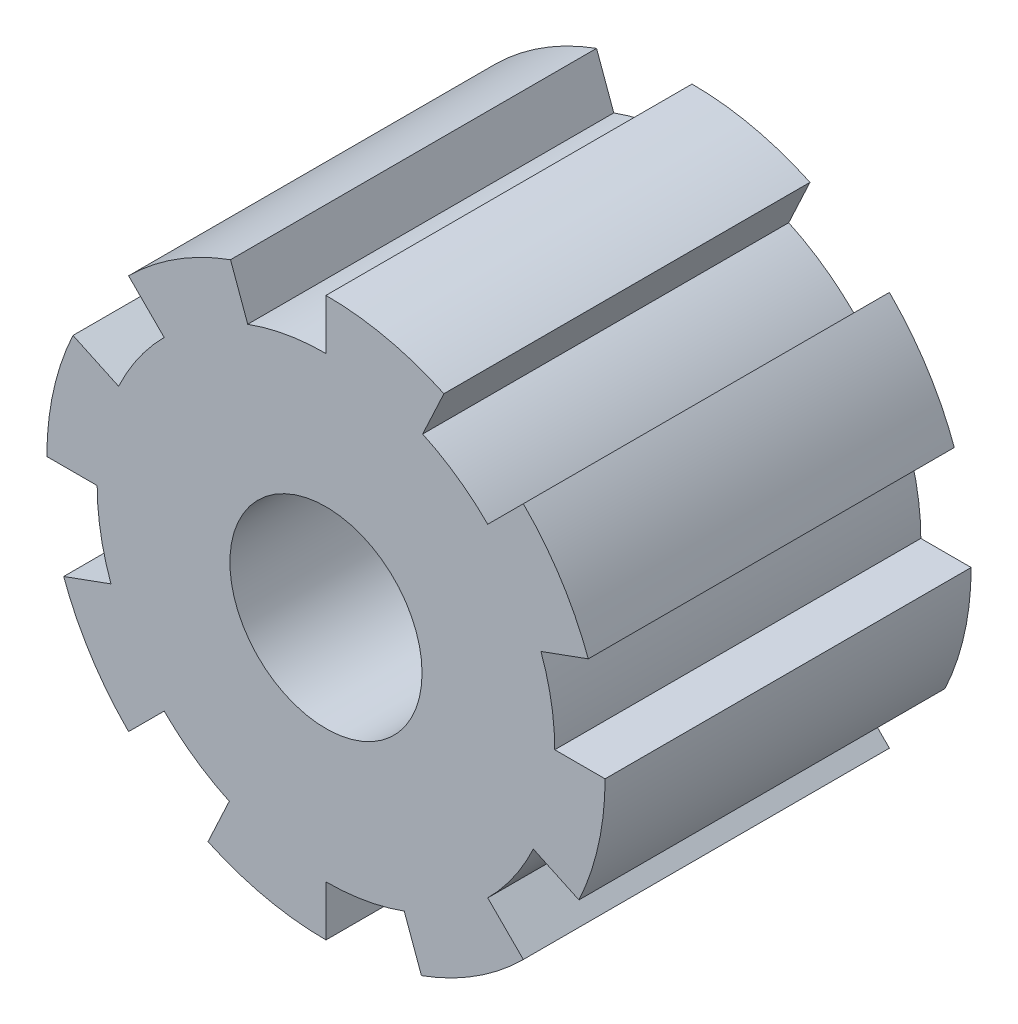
ISO-10303-21;
HEADER;
FILE_DESCRIPTION(('STEP AP214'),'2;1');
FILE_NAME('part.step','',(''),(''),'','','');
FILE_SCHEMA(('AUTOMOTIVE_DESIGN { 1 0 10303 214 1 1 1 1 }'));
ENDSEC;
DATA;
#1=APPLICATION_CONTEXT('core data for automotive mechanical design processes');
#2=APPLICATION_PROTOCOL_DEFINITION('international standard','automotive_design',2000,#1);
#3=PRODUCT_CONTEXT('',#1,'mechanical');
#4=PRODUCT('Part','Part','',(#3));
#5=PRODUCT_RELATED_PRODUCT_CATEGORY('part','',(#4));
#6=PRODUCT_DEFINITION_FORMATION('','',#4);
#7=PRODUCT_DEFINITION_CONTEXT('part definition',#1,'design');
#8=PRODUCT_DEFINITION('design','',#6,#7);
#9=PRODUCT_DEFINITION_SHAPE('','',#8);
#10=(LENGTH_UNIT() NAMED_UNIT(*) SI_UNIT(.MILLI.,.METRE.));
#11=(NAMED_UNIT(*) PLANE_ANGLE_UNIT() SI_UNIT($,.RADIAN.));
#12=(NAMED_UNIT(*) SI_UNIT($,.STERADIAN.) SOLID_ANGLE_UNIT());
#13=UNCERTAINTY_MEASURE_WITH_UNIT(LENGTH_MEASURE(1.E-05),#10,'distance_accuracy_value','');
#14=(GEOMETRIC_REPRESENTATION_CONTEXT(3) GLOBAL_UNCERTAINTY_ASSIGNED_CONTEXT((#13)) GLOBAL_UNIT_ASSIGNED_CONTEXT((#10,
#11,#12)) REPRESENTATION_CONTEXT('',''));
#15=CARTESIAN_POINT('',(0.,0.,0.));
#16=DIRECTION('',(0.,0.,1.));
#17=DIRECTION('',(1.,0.,0.));
#18=AXIS2_PLACEMENT_3D('',#15,#16,#17);
#19=CARTESIAN_POINT('',(0.,0.,8.));
#20=DIRECTION('',(0.,0.,-1.));
#21=DIRECTION('',(-1.,0.,0.));
#22=AXIS2_PLACEMENT_3D('',#19,#20,#21);
#23=CYLINDRICAL_SURFACE('',#22,5.);
#24=CARTESIAN_POINT('',(0.,0.,0.));
#25=DIRECTION('',(0.,0.,1.));
#26=DIRECTION('',(1.,0.,0.));
#27=AXIS2_PLACEMENT_3D('',#24,#25,#26);
#28=CIRCLE('',#27,5.);
#29=CARTESIAN_POINT('',(-5.,0.,0.));
#30=VERTEX_POINT('',#29);
#31=CARTESIAN_POINT('',(-4.69846310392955,-1.71010071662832,0.));
#32=VERTEX_POINT('',#31);
#33=EDGE_CURVE('E47',#30,#32,#28,.T.);
#34=ORIENTED_EDGE('',*,*,#33,.T.);
#35=DIRECTION('',(0.,0.,-1.));
#36=VECTOR('',#35,1.);
#37=CARTESIAN_POINT('',(-4.69846310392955,-1.71010071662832,8.));
#38=LINE('',#37,#36);
#39=CARTESIAN_POINT('',(-4.69846310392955,-1.71010071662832,8.));
#40=VERTEX_POINT('',#39);
#41=EDGE_CURVE('E67',#32,#40,#38,.F.);
#42=ORIENTED_EDGE('',*,*,#41,.T.);
#43=CARTESIAN_POINT('',(0.,0.,8.));
#44=DIRECTION('',(0.,0.,1.));
#45=DIRECTION('',(1.,0.,0.));
#46=AXIS2_PLACEMENT_3D('',#43,#44,#45);
#47=CIRCLE('',#46,5.);
#48=CARTESIAN_POINT('',(-5.,0.,8.));
#49=VERTEX_POINT('',#48);
#50=EDGE_CURVE('E11',#49,#40,#47,.T.);
#51=ORIENTED_EDGE('',*,*,#50,.F.);
#52=DIRECTION('',(0.,0.,-1.));
#53=VECTOR('',#52,1.);
#54=CARTESIAN_POINT('',(-5.,0.,8.));
#55=LINE('',#54,#53);
#56=EDGE_CURVE('E462',#49,#30,#55,.T.);
#57=ORIENTED_EDGE('',*,*,#56,.T.);
#58=EDGE_LOOP('',(#34,#42,#51,#57));
#59=FACE_BOUND('',#58,.T.);
#60=ADVANCED_FACE('F43',(#59),#23,.T.);
#61=CARTESIAN_POINT('',(-3.53553390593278,-3.53553390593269,8.));
#62=VERTEX_POINT('',#61);
#63=CARTESIAN_POINT('',(-2.11309130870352,-4.53153893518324,8.));
#64=VERTEX_POINT('',#63);
#65=EDGE_CURVE('E52',#62,#64,#47,.T.);
#66=ORIENTED_EDGE('',*,*,#65,.F.);
#67=DIRECTION('',(0.,0.,-1.));
#68=VECTOR('',#67,1.);
#69=CARTESIAN_POINT('',(-3.53553390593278,-3.53553390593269,8.));
#70=LINE('',#69,#68);
#71=CARTESIAN_POINT('',(-3.53553390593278,-3.53553390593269,0.));
#72=VERTEX_POINT('',#71);
#73=EDGE_CURVE('E284',#62,#72,#70,.T.);
#74=ORIENTED_EDGE('',*,*,#73,.T.);
#75=CARTESIAN_POINT('',(-2.11309130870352,-4.53153893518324,0.));
#76=VERTEX_POINT('',#75);
#77=EDGE_CURVE('E473',#72,#76,#28,.T.);
#78=ORIENTED_EDGE('',*,*,#77,.T.);
#79=DIRECTION('',(0.,0.,-1.));
#80=VECTOR('',#79,1.);
#81=CARTESIAN_POINT('',(-2.11309130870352,-4.53153893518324,8.));
#82=LINE('',#81,#80);
#83=EDGE_CURVE('E311',#76,#64,#82,.F.);
#84=ORIENTED_EDGE('',*,*,#83,.T.);
#85=EDGE_LOOP('',(#66,#74,#78,#84));
#86=FACE_BOUND('',#85,.T.);
#87=ADVANCED_FACE('F516',(#86),#23,.T.);
#88=CARTESIAN_POINT('',(0.,-5.,8.));
#89=VERTEX_POINT('',#88);
#90=CARTESIAN_POINT('',(1.71010071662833,-4.69846310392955,8.));
#91=VERTEX_POINT('',#90);
#92=EDGE_CURVE('E514',#89,#91,#47,.T.);
#93=ORIENTED_EDGE('',*,*,#92,.F.);
#94=DIRECTION('',(0.,0.,-1.));
#95=VECTOR('',#94,1.);
#96=CARTESIAN_POINT('',(0.,-5.,8.));
#97=LINE('',#96,#95);
#98=CARTESIAN_POINT('',(0.,-5.,0.));
#99=VERTEX_POINT('',#98);
#100=EDGE_CURVE('E291',#89,#99,#97,.T.);
#101=ORIENTED_EDGE('',*,*,#100,.T.);
#102=CARTESIAN_POINT('',(1.71010071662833,-4.69846310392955,0.));
#103=VERTEX_POINT('',#102);
#104=EDGE_CURVE('E475',#99,#103,#28,.T.);
#105=ORIENTED_EDGE('',*,*,#104,.T.);
#106=DIRECTION('',(0.,0.,-1.));
#107=VECTOR('',#106,1.);
#108=CARTESIAN_POINT('',(1.71010071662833,-4.69846310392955,8.));
#109=LINE('',#108,#107);
#110=EDGE_CURVE('E336',#103,#91,#109,.F.);
#111=ORIENTED_EDGE('',*,*,#110,.T.);
#112=EDGE_LOOP('',(#93,#101,#105,#111));
#113=FACE_BOUND('',#112,.T.);
#114=ADVANCED_FACE('F531',(#113),#23,.T.);
#115=CARTESIAN_POINT('',(3.53553390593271,-3.53553390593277,8.));
#116=VERTEX_POINT('',#115);
#117=CARTESIAN_POINT('',(4.53153893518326,-2.11309130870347,8.));
#118=VERTEX_POINT('',#117);
#119=EDGE_CURVE('E513',#116,#118,#47,.T.);
#120=ORIENTED_EDGE('',*,*,#119,.F.);
#121=DIRECTION('',(0.,0.,-1.));
#122=VECTOR('',#121,1.);
#123=CARTESIAN_POINT('',(3.53553390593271,-3.53553390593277,8.));
#124=LINE('',#123,#122);
#125=CARTESIAN_POINT('',(3.53553390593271,-3.53553390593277,0.));
#126=VERTEX_POINT('',#125);
#127=EDGE_CURVE('E333',#116,#126,#124,.T.);
#128=ORIENTED_EDGE('',*,*,#127,.T.);
#129=CARTESIAN_POINT('',(4.53153893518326,-2.11309130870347,0.));
#130=VERTEX_POINT('',#129);
#131=EDGE_CURVE('E477',#126,#130,#28,.T.);
#132=ORIENTED_EDGE('',*,*,#131,.T.);
#133=DIRECTION('',(0.,0.,-1.));
#134=VECTOR('',#133,1.);
#135=CARTESIAN_POINT('',(4.53153893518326,-2.11309130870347,8.));
#136=LINE('',#135,#134);
#137=EDGE_CURVE('E362',#130,#118,#136,.F.);
#138=ORIENTED_EDGE('',*,*,#137,.T.);
#139=EDGE_LOOP('',(#120,#128,#132,#138));
#140=FACE_BOUND('',#139,.T.);
#141=ADVANCED_FACE('F546',(#140),#23,.T.);
#142=CARTESIAN_POINT('',(5.,0.,8.));
#143=VERTEX_POINT('',#142);
#144=CARTESIAN_POINT('',(4.69846310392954,1.71010071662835,8.));
#145=VERTEX_POINT('',#144);
#146=EDGE_CURVE('E512',#143,#145,#47,.T.);
#147=ORIENTED_EDGE('',*,*,#146,.F.);
#148=DIRECTION('',(0.,0.,-1.));
#149=VECTOR('',#148,1.);
#150=CARTESIAN_POINT('',(5.,0.,8.));
#151=LINE('',#150,#149);
#152=CARTESIAN_POINT('',(5.,0.,0.));
#153=VERTEX_POINT('',#152);
#154=EDGE_CURVE('E342',#143,#153,#151,.T.);
#155=ORIENTED_EDGE('',*,*,#154,.T.);
#156=CARTESIAN_POINT('',(4.69846310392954,1.71010071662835,0.));
#157=VERTEX_POINT('',#156);
#158=EDGE_CURVE('E480',#153,#157,#28,.T.);
#159=ORIENTED_EDGE('',*,*,#158,.T.);
#160=DIRECTION('',(0.,0.,-1.));
#161=VECTOR('',#160,1.);
#162=CARTESIAN_POINT('',(4.69846310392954,1.71010071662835,8.));
#163=LINE('',#162,#161);
#164=EDGE_CURVE('E388',#157,#145,#163,.F.);
#165=ORIENTED_EDGE('',*,*,#164,.T.);
#166=EDGE_LOOP('',(#147,#155,#159,#165));
#167=FACE_BOUND('',#166,.T.);
#168=ADVANCED_FACE('F561',(#167),#23,.T.);
#169=CARTESIAN_POINT('',(3.53553390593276,3.53553390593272,8.));
#170=VERTEX_POINT('',#169);
#171=CARTESIAN_POINT('',(2.11309130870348,4.53153893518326,8.));
#172=VERTEX_POINT('',#171);
#173=EDGE_CURVE('E511',#170,#172,#47,.T.);
#174=ORIENTED_EDGE('',*,*,#173,.F.);
#175=DIRECTION('',(0.,0.,-1.));
#176=VECTOR('',#175,1.);
#177=CARTESIAN_POINT('',(3.53553390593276,3.53553390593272,8.));
#178=LINE('',#177,#176);
#179=CARTESIAN_POINT('',(3.53553390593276,3.53553390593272,0.));
#180=VERTEX_POINT('',#179);
#181=EDGE_CURVE('E385',#170,#180,#178,.T.);
#182=ORIENTED_EDGE('',*,*,#181,.T.);
#183=CARTESIAN_POINT('',(2.11309130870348,4.53153893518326,0.));
#184=VERTEX_POINT('',#183);
#185=EDGE_CURVE('E472',#180,#184,#28,.T.);
#186=ORIENTED_EDGE('',*,*,#185,.T.);
#187=DIRECTION('',(0.,0.,-1.));
#188=VECTOR('',#187,1.);
#189=CARTESIAN_POINT('',(2.11309130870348,4.53153893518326,8.));
#190=LINE('',#189,#188);
#191=EDGE_CURVE('E414',#184,#172,#190,.F.);
#192=ORIENTED_EDGE('',*,*,#191,.T.);
#193=EDGE_LOOP('',(#174,#182,#186,#192));
#194=FACE_BOUND('',#193,.T.);
#195=ADVANCED_FACE('F487',(#194),#23,.T.);
#196=CARTESIAN_POINT('',(0.,5.,8.));
#197=VERTEX_POINT('',#196);
#198=CARTESIAN_POINT('',(-1.71010071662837,4.69846310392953,8.));
#199=VERTEX_POINT('',#198);
#200=EDGE_CURVE('E474',#197,#199,#47,.T.);
#201=ORIENTED_EDGE('',*,*,#200,.F.);
#202=DIRECTION('',(0.,0.,-1.));
#203=VECTOR('',#202,1.);
#204=CARTESIAN_POINT('',(0.,5.,8.));
#205=LINE('',#204,#203);
#206=CARTESIAN_POINT('',(0.,5.,0.));
#207=VERTEX_POINT('',#206);
#208=EDGE_CURVE('E394',#197,#207,#205,.T.);
#209=ORIENTED_EDGE('',*,*,#208,.T.);
#210=CARTESIAN_POINT('',(-1.71010071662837,4.69846310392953,0.));
#211=VERTEX_POINT('',#210);
#212=EDGE_CURVE('E471',#207,#211,#28,.T.);
#213=ORIENTED_EDGE('',*,*,#212,.T.);
#214=DIRECTION('',(0.,0.,-1.));
#215=VECTOR('',#214,1.);
#216=CARTESIAN_POINT('',(-1.71010071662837,4.69846310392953,8.));
#217=LINE('',#216,#215);
#218=EDGE_CURVE('E440',#211,#199,#217,.F.);
#219=ORIENTED_EDGE('',*,*,#218,.T.);
#220=EDGE_LOOP('',(#201,#209,#213,#219));
#221=FACE_BOUND('',#220,.T.);
#222=ADVANCED_FACE('F508',(#221),#23,.T.);
#223=CARTESIAN_POINT('',(-3.53553390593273,3.53553390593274,8.));
#224=VERTEX_POINT('',#223);
#225=CARTESIAN_POINT('',(-4.53153893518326,2.11309130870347,8.));
#226=VERTEX_POINT('',#225);
#227=EDGE_CURVE('E53',#224,#226,#47,.T.);
#228=ORIENTED_EDGE('',*,*,#227,.F.);
#229=DIRECTION('',(0.,0.,-1.));
#230=VECTOR('',#229,1.);
#231=CARTESIAN_POINT('',(-3.53553390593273,3.53553390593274,8.));
#232=LINE('',#231,#230);
#233=CARTESIAN_POINT('',(-3.53553390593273,3.53553390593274,0.));
#234=VERTEX_POINT('',#233);
#235=EDGE_CURVE('E437',#224,#234,#232,.T.);
#236=ORIENTED_EDGE('',*,*,#235,.T.);
#237=CARTESIAN_POINT('',(-4.53153893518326,2.11309130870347,0.));
#238=VERTEX_POINT('',#237);
#239=EDGE_CURVE('E467',#234,#238,#28,.T.);
#240=ORIENTED_EDGE('',*,*,#239,.T.);
#241=DIRECTION('',(0.,0.,-1.));
#242=VECTOR('',#241,1.);
#243=CARTESIAN_POINT('',(-4.53153893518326,2.11309130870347,8.));
#244=LINE('',#243,#242);
#245=EDGE_CURVE('E465',#238,#226,#244,.F.);
#246=ORIENTED_EDGE('',*,*,#245,.T.);
#247=EDGE_LOOP('',(#228,#236,#240,#246));
#248=FACE_BOUND('',#247,.T.);
#249=ADVANCED_FACE('F45',(#248),#23,.T.);
#250=CARTESIAN_POINT('',(0.,0.,8.));
#251=DIRECTION('',(0.,0.,1.));
#252=DIRECTION('',(1.,0.,0.));
#253=AXIS2_PLACEMENT_3D('',#250,#251,#252);
#254=PLANE('',#253);
#255=CARTESIAN_POINT('',(0.,0.,8.));
#256=DIRECTION('',(0.,0.,1.));
#257=DIRECTION('',(1.,0.,0.));
#258=AXIS2_PLACEMENT_3D('',#255,#256,#257);
#259=CIRCLE('',#258,2.1);
#260=CARTESIAN_POINT('',(2.1,0.,8.));
#261=VERTEX_POINT('',#260);
#262=EDGE_CURVE('E635',#261,#261,#259,.T.);
#263=ORIENTED_EDGE('',*,*,#262,.F.);
#264=EDGE_LOOP('',(#263));
#265=FACE_BOUND('',#264,.T.);
#266=ORIENTED_EDGE('',*,*,#50,.T.);
#267=DIRECTION('',(-0.93969262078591,-0.342020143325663,0.));
#268=VECTOR('',#267,1.);
#269=CARTESIAN_POINT('',(-5.73212498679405,-2.08632287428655,8.));
#270=LINE('',#269,#268);
#271=CARTESIAN_POINT('',(-5.73212498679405,-2.08632287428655,8.));
#272=VERTEX_POINT('',#271);
#273=EDGE_CURVE('E253',#40,#272,#270,.T.);
#274=ORIENTED_EDGE('',*,*,#273,.T.);
#275=CARTESIAN_POINT('',(0.,0.,8.));
#276=DIRECTION('',(0.,0.,1.));
#277=DIRECTION('',(0.707106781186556,0.707106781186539,0.));
#278=AXIS2_PLACEMENT_3D('',#275,#276,#277);
#279=CIRCLE('',#278,6.1);
#280=CARTESIAN_POINT('',(-4.31335136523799,-4.31335136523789,8.));
#281=VERTEX_POINT('',#280);
#282=EDGE_CURVE('E258',#272,#281,#279,.T.);
#283=ORIENTED_EDGE('',*,*,#282,.T.);
#284=DIRECTION('',(0.707106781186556,0.707106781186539,0.));
#285=VECTOR('',#284,1.);
#286=CARTESIAN_POINT('',(0.,0.,8.));
#287=LINE('',#286,#285);
#288=EDGE_CURVE('E276',#281,#62,#287,.T.);
#289=ORIENTED_EDGE('',*,*,#288,.T.);
#290=ORIENTED_EDGE('',*,*,#65,.T.);
#291=DIRECTION('',(-0.422618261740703,-0.906307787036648,0.));
#292=VECTOR('',#291,1.);
#293=CARTESIAN_POINT('',(-2.57797139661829,-5.52847750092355,8.));
#294=LINE('',#293,#292);
#295=CARTESIAN_POINT('',(-2.57797139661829,-5.52847750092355,8.));
#296=VERTEX_POINT('',#295);
#297=EDGE_CURVE('E297',#64,#296,#294,.T.);
#298=ORIENTED_EDGE('',*,*,#297,.T.);
#299=CARTESIAN_POINT('',(0.,0.,8.));
#300=DIRECTION('',(0.,0.,1.));
#301=DIRECTION('',(0.,1.,0.));
#302=AXIS2_PLACEMENT_3D('',#299,#300,#301);
#303=CIRCLE('',#302,6.1);
#304=CARTESIAN_POINT('',(0.,-6.1,8.));
#305=VERTEX_POINT('',#304);
#306=EDGE_CURVE('E302',#296,#305,#303,.T.);
#307=ORIENTED_EDGE('',*,*,#306,.T.);
#308=DIRECTION('',(0.,1.,0.));
#309=VECTOR('',#308,1.);
#310=CARTESIAN_POINT('',(0.,0.,8.));
#311=LINE('',#310,#309);
#312=EDGE_CURVE('E298',#305,#89,#311,.T.);
#313=ORIENTED_EDGE('',*,*,#312,.T.);
#314=ORIENTED_EDGE('',*,*,#92,.T.);
#315=DIRECTION('',(0.342020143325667,-0.939692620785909,0.));
#316=VECTOR('',#315,1.);
#317=CARTESIAN_POINT('',(2.08632287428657,-5.73212498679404,8.));
#318=LINE('',#317,#316);
#319=CARTESIAN_POINT('',(2.08632287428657,-5.73212498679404,8.));
#320=VERTEX_POINT('',#319);
#321=EDGE_CURVE('E321',#91,#320,#318,.T.);
#322=ORIENTED_EDGE('',*,*,#321,.T.);
#323=CARTESIAN_POINT('',(0.,0.,8.));
#324=DIRECTION('',(0.,0.,1.));
#325=DIRECTION('',(-0.707106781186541,0.707106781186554,0.));
#326=AXIS2_PLACEMENT_3D('',#323,#324,#325);
#327=CIRCLE('',#326,6.1);
#328=CARTESIAN_POINT('',(4.3133513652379,-4.31335136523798,8.));
#329=VERTEX_POINT('',#328);
#330=EDGE_CURVE('E323',#320,#329,#327,.T.);
#331=ORIENTED_EDGE('',*,*,#330,.T.);
#332=DIRECTION('',(-0.707106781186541,0.707106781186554,0.));
#333=VECTOR('',#332,1.);
#334=CARTESIAN_POINT('',(0.,0.,8.));
#335=LINE('',#334,#333);
#336=EDGE_CURVE('E320',#329,#116,#335,.T.);
#337=ORIENTED_EDGE('',*,*,#336,.T.);
#338=ORIENTED_EDGE('',*,*,#119,.T.);
#339=DIRECTION('',(0.906307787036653,-0.422618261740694,0.));
#340=VECTOR('',#339,1.);
#341=CARTESIAN_POINT('',(5.52847750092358,-2.57797139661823,8.));
#342=LINE('',#341,#340);
#343=CARTESIAN_POINT('',(5.52847750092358,-2.57797139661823,8.));
#344=VERTEX_POINT('',#343);
#345=EDGE_CURVE('E348',#118,#344,#342,.T.);
#346=ORIENTED_EDGE('',*,*,#345,.T.);
#347=CARTESIAN_POINT('',(0.,0.,8.));
#348=DIRECTION('',(0.,0.,1.));
#349=DIRECTION('',(-1.,0.,0.));
#350=AXIS2_PLACEMENT_3D('',#347,#348,#349);
#351=CIRCLE('',#350,6.1);
#352=CARTESIAN_POINT('',(6.1,0.,8.));
#353=VERTEX_POINT('',#352);
#354=EDGE_CURVE('E353',#344,#353,#351,.T.);
#355=ORIENTED_EDGE('',*,*,#354,.T.);
#356=DIRECTION('',(-1.,0.,0.));
#357=VECTOR('',#356,1.);
#358=CARTESIAN_POINT('',(0.,0.,8.));
#359=LINE('',#358,#357);
#360=EDGE_CURVE('E349',#353,#143,#359,.T.);
#361=ORIENTED_EDGE('',*,*,#360,.T.);
#362=ORIENTED_EDGE('',*,*,#146,.T.);
#363=DIRECTION('',(0.939692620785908,0.34202014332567,0.));
#364=VECTOR('',#363,1.);
#365=CARTESIAN_POINT('',(5.73212498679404,2.08632287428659,8.));
#366=LINE('',#365,#364);
#367=CARTESIAN_POINT('',(5.73212498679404,2.08632287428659,8.));
#368=VERTEX_POINT('',#367);
#369=EDGE_CURVE('E373',#145,#368,#366,.T.);
#370=ORIENTED_EDGE('',*,*,#369,.T.);
#371=CARTESIAN_POINT('',(0.,0.,8.));
#372=DIRECTION('',(0.,0.,1.));
#373=DIRECTION('',(-0.707106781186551,-0.707106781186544,0.));
#374=AXIS2_PLACEMENT_3D('',#371,#372,#373);
#375=CIRCLE('',#374,6.1);
#376=CARTESIAN_POINT('',(4.31335136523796,4.31335136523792,8.));
#377=VERTEX_POINT('',#376);
#378=EDGE_CURVE('E375',#368,#377,#375,.T.);
#379=ORIENTED_EDGE('',*,*,#378,.T.);
#380=DIRECTION('',(-0.707106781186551,-0.707106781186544,0.));
#381=VECTOR('',#380,1.);
#382=CARTESIAN_POINT('',(0.,0.,8.));
#383=LINE('',#382,#381);
#384=EDGE_CURVE('E372',#377,#170,#383,.T.);
#385=ORIENTED_EDGE('',*,*,#384,.T.);
#386=ORIENTED_EDGE('',*,*,#173,.T.);
#387=DIRECTION('',(0.422618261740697,0.906307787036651,0.));
#388=VECTOR('',#387,1.);
#389=CARTESIAN_POINT('',(2.57797139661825,5.52847750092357,8.));
#390=LINE('',#389,#388);
#391=CARTESIAN_POINT('',(2.57797139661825,5.52847750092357,8.));
#392=VERTEX_POINT('',#391);
#393=EDGE_CURVE('E400',#172,#392,#390,.T.);
#394=ORIENTED_EDGE('',*,*,#393,.T.);
#395=CARTESIAN_POINT('',(0.,0.,8.));
#396=DIRECTION('',(0.,0.,1.));
#397=DIRECTION('',(0.,-1.,0.));
#398=AXIS2_PLACEMENT_3D('',#395,#396,#397);
#399=CIRCLE('',#398,6.1);
#400=CARTESIAN_POINT('',(0.,6.1,8.));
#401=VERTEX_POINT('',#400);
#402=EDGE_CURVE('E405',#392,#401,#399,.T.);
#403=ORIENTED_EDGE('',*,*,#402,.T.);
#404=DIRECTION('',(0.,-1.,0.));
#405=VECTOR('',#404,1.);
#406=CARTESIAN_POINT('',(0.,0.,8.));
#407=LINE('',#406,#405);
#408=EDGE_CURVE('E401',#401,#197,#407,.T.);
#409=ORIENTED_EDGE('',*,*,#408,.T.);
#410=ORIENTED_EDGE('',*,*,#200,.T.);
#411=DIRECTION('',(-0.342020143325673,0.939692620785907,0.));
#412=VECTOR('',#411,1.);
#413=CARTESIAN_POINT('',(-2.08632287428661,5.73212498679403,8.));
#414=LINE('',#413,#412);
#415=CARTESIAN_POINT('',(-2.08632287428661,5.73212498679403,8.));
#416=VERTEX_POINT('',#415);
#417=EDGE_CURVE('E417',#199,#416,#414,.T.);
#418=ORIENTED_EDGE('',*,*,#417,.T.);
#419=CARTESIAN_POINT('',(0.,0.,8.));
#420=DIRECTION('',(0.,0.,1.));
#421=DIRECTION('',(0.707106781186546,-0.707106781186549,0.));
#422=AXIS2_PLACEMENT_3D('',#419,#420,#421);
#423=CIRCLE('',#422,6.1);
#424=CARTESIAN_POINT('',(-4.31335136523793,4.31335136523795,8.));
#425=VERTEX_POINT('',#424);
#426=EDGE_CURVE('E426',#416,#425,#423,.T.);
#427=ORIENTED_EDGE('',*,*,#426,.T.);
#428=DIRECTION('',(0.707106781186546,-0.707106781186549,0.));
#429=VECTOR('',#428,1.);
#430=CARTESIAN_POINT('',(0.,0.,8.));
#431=LINE('',#430,#429);
#432=EDGE_CURVE('E429',#425,#224,#431,.T.);
#433=ORIENTED_EDGE('',*,*,#432,.T.);
#434=ORIENTED_EDGE('',*,*,#227,.T.);
#435=DIRECTION('',(-0.906307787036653,0.422618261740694,0.));
#436=VECTOR('',#435,1.);
#437=CARTESIAN_POINT('',(-5.52847750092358,2.57797139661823,8.));
#438=LINE('',#437,#436);
#439=CARTESIAN_POINT('',(-5.52847750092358,2.57797139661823,8.));
#440=VERTEX_POINT('',#439);
#441=EDGE_CURVE('E443',#226,#440,#438,.T.);
#442=ORIENTED_EDGE('',*,*,#441,.T.);
#443=CARTESIAN_POINT('',(0.,0.,8.));
#444=DIRECTION('',(0.,0.,1.));
#445=DIRECTION('',(1.,0.,0.));
#446=AXIS2_PLACEMENT_3D('',#443,#444,#445);
#447=CIRCLE('',#446,6.1);
#448=CARTESIAN_POINT('',(-6.1,0.,8.));
#449=VERTEX_POINT('',#448);
#450=EDGE_CURVE('E452',#440,#449,#447,.T.);
#451=ORIENTED_EDGE('',*,*,#450,.T.);
#452=DIRECTION('',(1.,0.,0.));
#453=VECTOR('',#452,1.);
#454=CARTESIAN_POINT('',(0.,0.,8.));
#455=LINE('',#454,#453);
#456=EDGE_CURVE('E455',#449,#49,#455,.T.);
#457=ORIENTED_EDGE('',*,*,#456,.T.);
#458=EDGE_LOOP('',(#266,#274,#283,#289,#290,#298,#307,#313,#314,#322,#331,#337,#338,#346,#355,
#361,#362,#370,#379,#385,#386,#394,#403,#409,#410,#418,#427,#433,#434,#442,#451,#457));
#459=FACE_BOUND('',#458,.T.);
#460=ADVANCED_FACE('F255',(#265,#459),#254,.T.);
#461=CARTESIAN_POINT('',(0.,0.,0.));
#462=DIRECTION('',(0.,0.,1.));
#463=DIRECTION('',(1.,0.,0.));
#464=AXIS2_PLACEMENT_3D('',#461,#462,#463);
#465=PLANE('',#464);
#466=CARTESIAN_POINT('',(0.,0.,0.));
#467=DIRECTION('',(0.,0.,1.));
#468=DIRECTION('',(1.,0.,0.));
#469=AXIS2_PLACEMENT_3D('',#466,#467,#468);
#470=CIRCLE('',#469,2.1);
#471=CARTESIAN_POINT('',(2.1,0.,0.));
#472=VERTEX_POINT('',#471);
#473=EDGE_CURVE('E272',#472,#472,#470,.T.);
#474=ORIENTED_EDGE('',*,*,#473,.T.);
#475=EDGE_LOOP('',(#474));
#476=FACE_BOUND('',#475,.T.);
#477=ORIENTED_EDGE('',*,*,#77,.F.);
#478=DIRECTION('',(-0.707106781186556,-0.707106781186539,0.));
#479=VECTOR('',#478,1.);
#480=CARTESIAN_POINT('',(0.,0.,0.));
#481=LINE('',#480,#479);
#482=CARTESIAN_POINT('',(-4.31335136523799,-4.31335136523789,0.));
#483=VERTEX_POINT('',#482);
#484=EDGE_CURVE('E285',#72,#483,#481,.T.);
#485=ORIENTED_EDGE('',*,*,#484,.T.);
#486=CARTESIAN_POINT('',(0.,0.,0.));
#487=DIRECTION('',(0.,0.,1.));
#488=DIRECTION('',(1.,0.,0.));
#489=AXIS2_PLACEMENT_3D('',#486,#487,#488);
#490=CIRCLE('',#489,6.1);
#491=CARTESIAN_POINT('',(-5.73212498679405,-2.08632287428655,0.));
#492=VERTEX_POINT('',#491);
#493=EDGE_CURVE('E282',#483,#492,#490,.F.);
#494=ORIENTED_EDGE('',*,*,#493,.T.);
#495=DIRECTION('',(0.93969262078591,0.342020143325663,0.));
#496=VECTOR('',#495,1.);
#497=CARTESIAN_POINT('',(-5.73212498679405,-2.08632287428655,0.));
#498=LINE('',#497,#496);
#499=EDGE_CURVE('E269',#492,#32,#498,.T.);
#500=ORIENTED_EDGE('',*,*,#499,.T.);
#501=ORIENTED_EDGE('',*,*,#33,.F.);
#502=DIRECTION('',(-1.,0.,0.));
#503=VECTOR('',#502,1.);
#504=CARTESIAN_POINT('',(0.,0.,0.));
#505=LINE('',#504,#503);
#506=CARTESIAN_POINT('',(-6.1,0.,0.));
#507=VERTEX_POINT('',#506);
#508=EDGE_CURVE('E444',#30,#507,#505,.T.);
#509=ORIENTED_EDGE('',*,*,#508,.T.);
#510=CARTESIAN_POINT('',(0.,0.,0.));
#511=DIRECTION('',(0.,0.,1.));
#512=DIRECTION('',(1.,0.,0.));
#513=AXIS2_PLACEMENT_3D('',#510,#511,#512);
#514=CIRCLE('',#513,6.1);
#515=CARTESIAN_POINT('',(-5.52847750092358,2.57797139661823,0.));
#516=VERTEX_POINT('',#515);
#517=EDGE_CURVE('E450',#507,#516,#514,.F.);
#518=ORIENTED_EDGE('',*,*,#517,.T.);
#519=DIRECTION('',(0.906307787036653,-0.422618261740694,0.));
#520=VECTOR('',#519,1.);
#521=CARTESIAN_POINT('',(-5.52847750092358,2.57797139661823,0.));
#522=LINE('',#521,#520);
#523=EDGE_CURVE('E446',#516,#238,#522,.T.);
#524=ORIENTED_EDGE('',*,*,#523,.T.);
#525=ORIENTED_EDGE('',*,*,#239,.F.);
#526=DIRECTION('',(-0.707106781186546,0.707106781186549,0.));
#527=VECTOR('',#526,1.);
#528=CARTESIAN_POINT('',(0.,0.,0.));
#529=LINE('',#528,#527);
#530=CARTESIAN_POINT('',(-4.31335136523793,4.31335136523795,0.));
#531=VERTEX_POINT('',#530);
#532=EDGE_CURVE('E418',#234,#531,#529,.T.);
#533=ORIENTED_EDGE('',*,*,#532,.T.);
#534=CARTESIAN_POINT('',(0.,0.,0.));
#535=DIRECTION('',(0.,0.,1.));
#536=DIRECTION('',(1.,0.,0.));
#537=AXIS2_PLACEMENT_3D('',#534,#535,#536);
#538=CIRCLE('',#537,6.1);
#539=CARTESIAN_POINT('',(-2.08632287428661,5.73212498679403,0.));
#540=VERTEX_POINT('',#539);
#541=EDGE_CURVE('E424',#531,#540,#538,.F.);
#542=ORIENTED_EDGE('',*,*,#541,.T.);
#543=DIRECTION('',(0.342020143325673,-0.939692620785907,0.));
#544=VECTOR('',#543,1.);
#545=CARTESIAN_POINT('',(-2.08632287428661,5.73212498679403,0.));
#546=LINE('',#545,#544);
#547=EDGE_CURVE('E420',#540,#211,#546,.T.);
#548=ORIENTED_EDGE('',*,*,#547,.T.);
#549=ORIENTED_EDGE('',*,*,#212,.F.);
#550=DIRECTION('',(0.,1.,0.));
#551=VECTOR('',#550,1.);
#552=CARTESIAN_POINT('',(0.,0.,0.));
#553=LINE('',#552,#551);
#554=CARTESIAN_POINT('',(0.,6.1,0.));
#555=VERTEX_POINT('',#554);
#556=EDGE_CURVE('E395',#207,#555,#553,.T.);
#557=ORIENTED_EDGE('',*,*,#556,.T.);
#558=CARTESIAN_POINT('',(0.,0.,0.));
#559=DIRECTION('',(0.,0.,1.));
#560=DIRECTION('',(1.,0.,0.));
#561=AXIS2_PLACEMENT_3D('',#558,#559,#560);
#562=CIRCLE('',#561,6.1);
#563=CARTESIAN_POINT('',(2.57797139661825,5.52847750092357,0.));
#564=VERTEX_POINT('',#563);
#565=EDGE_CURVE('E392',#555,#564,#562,.F.);
#566=ORIENTED_EDGE('',*,*,#565,.T.);
#567=DIRECTION('',(-0.422618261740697,-0.906307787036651,0.));
#568=VECTOR('',#567,1.);
#569=CARTESIAN_POINT('',(2.57797139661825,5.52847750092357,0.));
#570=LINE('',#569,#568);
#571=EDGE_CURVE('E404',#564,#184,#570,.T.);
#572=ORIENTED_EDGE('',*,*,#571,.T.);
#573=ORIENTED_EDGE('',*,*,#185,.F.);
#574=DIRECTION('',(0.707106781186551,0.707106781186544,0.));
#575=VECTOR('',#574,1.);
#576=CARTESIAN_POINT('',(0.,0.,0.));
#577=LINE('',#576,#575);
#578=CARTESIAN_POINT('',(4.31335136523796,4.31335136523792,0.));
#579=VERTEX_POINT('',#578);
#580=EDGE_CURVE('E366',#180,#579,#577,.T.);
#581=ORIENTED_EDGE('',*,*,#580,.T.);
#582=CARTESIAN_POINT('',(0.,0.,0.));
#583=DIRECTION('',(0.,0.,1.));
#584=DIRECTION('',(1.,0.,0.));
#585=AXIS2_PLACEMENT_3D('',#582,#583,#584);
#586=CIRCLE('',#585,6.1);
#587=CARTESIAN_POINT('',(5.73212498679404,2.08632287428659,0.));
#588=VERTEX_POINT('',#587);
#589=EDGE_CURVE('E368',#579,#588,#586,.F.);
#590=ORIENTED_EDGE('',*,*,#589,.T.);
#591=DIRECTION('',(-0.939692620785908,-0.34202014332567,0.));
#592=VECTOR('',#591,1.);
#593=CARTESIAN_POINT('',(5.73212498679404,2.08632287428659,0.));
#594=LINE('',#593,#592);
#595=EDGE_CURVE('E369',#588,#157,#594,.T.);
#596=ORIENTED_EDGE('',*,*,#595,.T.);
#597=ORIENTED_EDGE('',*,*,#158,.F.);
#598=DIRECTION('',(1.,0.,0.));
#599=VECTOR('',#598,1.);
#600=CARTESIAN_POINT('',(0.,0.,0.));
#601=LINE('',#600,#599);
#602=CARTESIAN_POINT('',(6.1,0.,0.));
#603=VERTEX_POINT('',#602);
#604=EDGE_CURVE('E343',#153,#603,#601,.T.);
#605=ORIENTED_EDGE('',*,*,#604,.T.);
#606=CARTESIAN_POINT('',(0.,0.,0.));
#607=DIRECTION('',(0.,0.,1.));
#608=DIRECTION('',(1.,0.,0.));
#609=AXIS2_PLACEMENT_3D('',#606,#607,#608);
#610=CIRCLE('',#609,6.1);
#611=CARTESIAN_POINT('',(5.52847750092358,-2.57797139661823,0.));
#612=VERTEX_POINT('',#611);
#613=EDGE_CURVE('E340',#603,#612,#610,.F.);
#614=ORIENTED_EDGE('',*,*,#613,.T.);
#615=DIRECTION('',(-0.906307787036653,0.422618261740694,0.));
#616=VECTOR('',#615,1.);
#617=CARTESIAN_POINT('',(5.52847750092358,-2.57797139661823,0.));
#618=LINE('',#617,#616);
#619=EDGE_CURVE('E352',#612,#130,#618,.T.);
#620=ORIENTED_EDGE('',*,*,#619,.T.);
#621=ORIENTED_EDGE('',*,*,#131,.F.);
#622=DIRECTION('',(0.707106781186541,-0.707106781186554,0.));
#623=VECTOR('',#622,1.);
#624=CARTESIAN_POINT('',(0.,0.,0.));
#625=LINE('',#624,#623);
#626=CARTESIAN_POINT('',(4.3133513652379,-4.31335136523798,0.));
#627=VERTEX_POINT('',#626);
#628=EDGE_CURVE('E314',#126,#627,#625,.T.);
#629=ORIENTED_EDGE('',*,*,#628,.T.);
#630=CARTESIAN_POINT('',(0.,0.,0.));
#631=DIRECTION('',(0.,0.,1.));
#632=DIRECTION('',(1.,0.,0.));
#633=AXIS2_PLACEMENT_3D('',#630,#631,#632);
#634=CIRCLE('',#633,6.1);
#635=CARTESIAN_POINT('',(2.08632287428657,-5.73212498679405,0.));
#636=VERTEX_POINT('',#635);
#637=EDGE_CURVE('E316',#627,#636,#634,.F.);
#638=ORIENTED_EDGE('',*,*,#637,.T.);
#639=DIRECTION('',(-0.342020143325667,0.939692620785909,0.));
#640=VECTOR('',#639,1.);
#641=CARTESIAN_POINT('',(2.08632287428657,-5.73212498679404,0.));
#642=LINE('',#641,#640);
#643=EDGE_CURVE('E317',#636,#103,#642,.T.);
#644=ORIENTED_EDGE('',*,*,#643,.T.);
#645=ORIENTED_EDGE('',*,*,#104,.F.);
#646=DIRECTION('',(0.,-1.,0.));
#647=VECTOR('',#646,1.);
#648=CARTESIAN_POINT('',(0.,0.,0.));
#649=LINE('',#648,#647);
#650=CARTESIAN_POINT('',(0.,-6.1,0.));
#651=VERTEX_POINT('',#650);
#652=EDGE_CURVE('E292',#99,#651,#649,.T.);
#653=ORIENTED_EDGE('',*,*,#652,.T.);
#654=CARTESIAN_POINT('',(0.,0.,0.));
#655=DIRECTION('',(0.,0.,1.));
#656=DIRECTION('',(1.,0.,0.));
#657=AXIS2_PLACEMENT_3D('',#654,#655,#656);
#658=CIRCLE('',#657,6.1);
#659=CARTESIAN_POINT('',(-2.57797139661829,-5.52847750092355,0.));
#660=VERTEX_POINT('',#659);
#661=EDGE_CURVE('E289',#651,#660,#658,.F.);
#662=ORIENTED_EDGE('',*,*,#661,.T.);
#663=DIRECTION('',(0.422618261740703,0.906307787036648,0.));
#664=VECTOR('',#663,1.);
#665=CARTESIAN_POINT('',(-2.57797139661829,-5.52847750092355,0.));
#666=LINE('',#665,#664);
#667=EDGE_CURVE('E301',#660,#76,#666,.T.);
#668=ORIENTED_EDGE('',*,*,#667,.T.);
#669=EDGE_LOOP('',(#477,#485,#494,#500,#501,#509,#518,#524,#525,#533,#542,#548,#549,#557,#566,
#572,#573,#581,#590,#596,#597,#605,#614,#620,#621,#629,#638,#644,#645,#653,#662,#668));
#670=FACE_BOUND('',#669,.T.);
#671=ADVANCED_FACE('F496',(#476,#670),#465,.F.);
#672=CARTESIAN_POINT('',(-5.52847750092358,2.57797139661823,-6.62238148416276));
#673=DIRECTION('',(0.422618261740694,0.906307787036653,0.));
#674=DIRECTION('',(-0.906307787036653,0.422618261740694,0.));
#675=AXIS2_PLACEMENT_3D('',#672,#673,#674);
#676=PLANE('',#675);
#677=ORIENTED_EDGE('',*,*,#245,.F.);
#678=ORIENTED_EDGE('',*,*,#523,.F.);
#679=DIRECTION('',(0.,0.,1.));
#680=VECTOR('',#679,1.);
#681=CARTESIAN_POINT('',(-5.52847750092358,2.57797139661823,-6.62238148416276));
#682=LINE('',#681,#680);
#683=EDGE_CURVE('E457',#516,#440,#682,.T.);
#684=ORIENTED_EDGE('',*,*,#683,.T.);
#685=ORIENTED_EDGE('',*,*,#441,.F.);
#686=EDGE_LOOP('',(#677,#678,#684,#685));
#687=FACE_BOUND('',#686,.T.);
#688=ADVANCED_FACE('F623',(#687),#676,.T.);
#689=CARTESIAN_POINT('',(0.,0.,-6.62238148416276));
#690=DIRECTION('',(0.,-1.,0.));
#691=DIRECTION('',(0.,0.,-1.));
#692=AXIS2_PLACEMENT_3D('',#689,#690,#691);
#693=PLANE('',#692);
#694=ORIENTED_EDGE('',*,*,#56,.F.);
#695=ORIENTED_EDGE('',*,*,#456,.F.);
#696=DIRECTION('',(0.,0.,1.));
#697=VECTOR('',#696,1.);
#698=CARTESIAN_POINT('',(-6.1,0.,-6.62238148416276));
#699=LINE('',#698,#697);
#700=EDGE_CURVE('E447',#507,#449,#699,.T.);
#701=ORIENTED_EDGE('',*,*,#700,.F.);
#702=ORIENTED_EDGE('',*,*,#508,.F.);
#703=EDGE_LOOP('',(#694,#695,#701,#702));
#704=FACE_BOUND('',#703,.T.);
#705=ADVANCED_FACE('F617',(#704),#693,.T.);
#706=CARTESIAN_POINT('',(0.,0.,-6.62238148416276));
#707=DIRECTION('',(0.,0.,1.));
#708=DIRECTION('',(1.,0.,0.));
#709=AXIS2_PLACEMENT_3D('',#706,#707,#708);
#710=CYLINDRICAL_SURFACE('',#709,6.1);
#711=ORIENTED_EDGE('',*,*,#517,.F.);
#712=ORIENTED_EDGE('',*,*,#700,.T.);
#713=ORIENTED_EDGE('',*,*,#450,.F.);
#714=ORIENTED_EDGE('',*,*,#683,.F.);
#715=EDGE_LOOP('',(#711,#712,#713,#714));
#716=FACE_BOUND('',#715,.T.);
#717=ADVANCED_FACE('F610',(#716),#710,.T.);
#718=CARTESIAN_POINT('',(-2.08632287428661,5.73212498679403,-7.17371987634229));
#719=DIRECTION('',(0.939692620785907,0.342020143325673,0.));
#720=DIRECTION('',(-0.342020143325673,0.939692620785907,0.));
#721=AXIS2_PLACEMENT_3D('',#718,#719,#720);
#722=PLANE('',#721);
#723=ORIENTED_EDGE('',*,*,#218,.F.);
#724=ORIENTED_EDGE('',*,*,#547,.F.);
#725=DIRECTION('',(0.,0.,1.));
#726=VECTOR('',#725,1.);
#727=CARTESIAN_POINT('',(-2.08632287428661,5.73212498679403,-7.17371987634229));
#728=LINE('',#727,#726);
#729=EDGE_CURVE('E432',#540,#416,#728,.T.);
#730=ORIENTED_EDGE('',*,*,#729,.T.);
#731=ORIENTED_EDGE('',*,*,#417,.F.);
#732=EDGE_LOOP('',(#723,#724,#730,#731));
#733=FACE_BOUND('',#732,.T.);
#734=ADVANCED_FACE('F608',(#733),#722,.T.);
#735=CARTESIAN_POINT('',(0.,0.,-7.17371987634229));
#736=DIRECTION('',(-0.707106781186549,-0.707106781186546,0.));
#737=DIRECTION('',(0.707106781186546,-0.707106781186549,0.));
#738=AXIS2_PLACEMENT_3D('',#735,#736,#737);
#739=PLANE('',#738);
#740=ORIENTED_EDGE('',*,*,#235,.F.);
#741=ORIENTED_EDGE('',*,*,#432,.F.);
#742=DIRECTION('',(0.,0.,1.));
#743=VECTOR('',#742,1.);
#744=CARTESIAN_POINT('',(-4.31335136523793,4.31335136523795,-7.17371987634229));
#745=LINE('',#744,#743);
#746=EDGE_CURVE('E421',#531,#425,#745,.T.);
#747=ORIENTED_EDGE('',*,*,#746,.F.);
#748=ORIENTED_EDGE('',*,*,#532,.F.);
#749=EDGE_LOOP('',(#740,#741,#747,#748));
#750=FACE_BOUND('',#749,.T.);
#751=ADVANCED_FACE('F599',(#750),#739,.T.);
#752=CARTESIAN_POINT('',(0.,0.,-7.17371987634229));
#753=DIRECTION('',(0.,0.,1.));
#754=DIRECTION('',(1.,0.,0.));
#755=AXIS2_PLACEMENT_3D('',#752,#753,#754);
#756=CYLINDRICAL_SURFACE('',#755,6.1);
#757=ORIENTED_EDGE('',*,*,#541,.F.);
#758=ORIENTED_EDGE('',*,*,#746,.T.);
#759=ORIENTED_EDGE('',*,*,#426,.F.);
#760=ORIENTED_EDGE('',*,*,#729,.F.);
#761=EDGE_LOOP('',(#757,#758,#759,#760));
#762=FACE_BOUND('',#761,.T.);
#763=ADVANCED_FACE('F605',(#762),#756,.T.);
#764=CARTESIAN_POINT('',(2.57797139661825,5.52847750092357,-6.62238148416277));
#765=DIRECTION('',(0.906307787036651,-0.422618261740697,0.));
#766=DIRECTION('',(0.422618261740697,0.906307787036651,0.));
#767=AXIS2_PLACEMENT_3D('',#764,#765,#766);
#768=PLANE('',#767);
#769=ORIENTED_EDGE('',*,*,#191,.F.);
#770=ORIENTED_EDGE('',*,*,#571,.F.);
#771=DIRECTION('',(0.,0.,1.));
#772=VECTOR('',#771,1.);
#773=CARTESIAN_POINT('',(2.57797139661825,5.52847750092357,-6.62238148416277));
#774=LINE('',#773,#772);
#775=EDGE_CURVE('E391',#564,#392,#774,.T.);
#776=ORIENTED_EDGE('',*,*,#775,.T.);
#777=ORIENTED_EDGE('',*,*,#393,.F.);
#778=EDGE_LOOP('',(#769,#770,#776,#777));
#779=FACE_BOUND('',#778,.T.);
#780=ADVANCED_FACE('F494',(#779),#768,.T.);
#781=CARTESIAN_POINT('',(0.,0.,-6.62238148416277));
#782=DIRECTION('',(-1.,0.,0.));
#783=DIRECTION('',(0.,-1.,0.));
#784=AXIS2_PLACEMENT_3D('',#781,#782,#783);
#785=PLANE('',#784);
#786=ORIENTED_EDGE('',*,*,#208,.F.);
#787=ORIENTED_EDGE('',*,*,#408,.F.);
#788=DIRECTION('',(0.,0.,1.));
#789=VECTOR('',#788,1.);
#790=CARTESIAN_POINT('',(0.,6.1,-6.62238148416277));
#791=LINE('',#790,#789);
#792=EDGE_CURVE('E398',#555,#401,#791,.T.);
#793=ORIENTED_EDGE('',*,*,#792,.F.);
#794=ORIENTED_EDGE('',*,*,#556,.F.);
#795=EDGE_LOOP('',(#786,#787,#793,#794));
#796=FACE_BOUND('',#795,.T.);
#797=ADVANCED_FACE('F506',(#796),#785,.T.);
#798=CARTESIAN_POINT('',(0.,0.,-6.62238148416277));
#799=DIRECTION('',(0.,0.,1.));
#800=DIRECTION('',(1.,0.,0.));
#801=AXIS2_PLACEMENT_3D('',#798,#799,#800);
#802=CYLINDRICAL_SURFACE('',#801,6.1);
#803=ORIENTED_EDGE('',*,*,#565,.F.);
#804=ORIENTED_EDGE('',*,*,#792,.T.);
#805=ORIENTED_EDGE('',*,*,#402,.F.);
#806=ORIENTED_EDGE('',*,*,#775,.F.);
#807=EDGE_LOOP('',(#803,#804,#805,#806));
#808=FACE_BOUND('',#807,.T.);
#809=ADVANCED_FACE('F501',(#808),#802,.T.);
#810=CARTESIAN_POINT('',(5.73212498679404,2.08632287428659,-7.17371987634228));
#811=DIRECTION('',(0.34202014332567,-0.939692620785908,0.));
#812=DIRECTION('',(0.939692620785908,0.34202014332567,0.));
#813=AXIS2_PLACEMENT_3D('',#810,#811,#812);
#814=PLANE('',#813);
#815=ORIENTED_EDGE('',*,*,#164,.F.);
#816=ORIENTED_EDGE('',*,*,#595,.F.);
#817=DIRECTION('',(0.,0.,1.));
#818=VECTOR('',#817,1.);
#819=CARTESIAN_POINT('',(5.73212498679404,2.08632287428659,-7.17371987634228));
#820=LINE('',#819,#818);
#821=EDGE_CURVE('E365',#588,#368,#820,.T.);
#822=ORIENTED_EDGE('',*,*,#821,.T.);
#823=ORIENTED_EDGE('',*,*,#369,.F.);
#824=EDGE_LOOP('',(#815,#816,#822,#823));
#825=FACE_BOUND('',#824,.T.);
#826=ADVANCED_FACE('F565',(#825),#814,.T.);
#827=CARTESIAN_POINT('',(0.,0.,-7.17371987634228));
#828=DIRECTION('',(-0.707106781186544,0.707106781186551,0.));
#829=DIRECTION('',(-0.707106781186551,-0.707106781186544,0.));
#830=AXIS2_PLACEMENT_3D('',#827,#828,#829);
#831=PLANE('',#830);
#832=ORIENTED_EDGE('',*,*,#181,.F.);
#833=ORIENTED_EDGE('',*,*,#384,.F.);
#834=DIRECTION('',(0.,0.,1.));
#835=VECTOR('',#834,1.);
#836=CARTESIAN_POINT('',(4.31335136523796,4.31335136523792,-7.17371987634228));
#837=LINE('',#836,#835);
#838=EDGE_CURVE('E376',#579,#377,#837,.T.);
#839=ORIENTED_EDGE('',*,*,#838,.F.);
#840=ORIENTED_EDGE('',*,*,#580,.F.);
#841=EDGE_LOOP('',(#832,#833,#839,#840));
#842=FACE_BOUND('',#841,.T.);
#843=ADVANCED_FACE('F572',(#842),#831,.T.);
#844=CARTESIAN_POINT('',(0.,0.,-7.17371987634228));
#845=DIRECTION('',(0.,0.,1.));
#846=DIRECTION('',(1.,0.,0.));
#847=AXIS2_PLACEMENT_3D('',#844,#845,#846);
#848=CYLINDRICAL_SURFACE('',#847,6.1);
#849=ORIENTED_EDGE('',*,*,#589,.F.);
#850=ORIENTED_EDGE('',*,*,#838,.T.);
#851=ORIENTED_EDGE('',*,*,#378,.F.);
#852=ORIENTED_EDGE('',*,*,#821,.F.);
#853=EDGE_LOOP('',(#849,#850,#851,#852));
#854=FACE_BOUND('',#853,.T.);
#855=ADVANCED_FACE('F574',(#854),#848,.T.);
#856=CARTESIAN_POINT('',(5.52847750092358,-2.57797139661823,-6.62238148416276));
#857=DIRECTION('',(-0.422618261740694,-0.906307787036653,0.));
#858=DIRECTION('',(0.906307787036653,-0.422618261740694,0.));
#859=AXIS2_PLACEMENT_3D('',#856,#857,#858);
#860=PLANE('',#859);
#861=ORIENTED_EDGE('',*,*,#137,.F.);
#862=ORIENTED_EDGE('',*,*,#619,.F.);
#863=DIRECTION('',(0.,0.,1.));
#864=VECTOR('',#863,1.);
#865=CARTESIAN_POINT('',(5.52847750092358,-2.57797139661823,-6.62238148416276));
#866=LINE('',#865,#864);
#867=EDGE_CURVE('E339',#612,#344,#866,.T.);
#868=ORIENTED_EDGE('',*,*,#867,.T.);
#869=ORIENTED_EDGE('',*,*,#345,.F.);
#870=EDGE_LOOP('',(#861,#862,#868,#869));
#871=FACE_BOUND('',#870,.T.);
#872=ADVANCED_FACE('F550',(#871),#860,.T.);
#873=CARTESIAN_POINT('',(0.,0.,-6.62238148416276));
#874=DIRECTION('',(0.,1.,0.));
#875=DIRECTION('',(0.,0.,1.));
#876=AXIS2_PLACEMENT_3D('',#873,#874,#875);
#877=PLANE('',#876);
#878=ORIENTED_EDGE('',*,*,#154,.F.);
#879=ORIENTED_EDGE('',*,*,#360,.F.);
#880=DIRECTION('',(0.,0.,1.));
#881=VECTOR('',#880,1.);
#882=CARTESIAN_POINT('',(6.1,0.,-6.62238148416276));
#883=LINE('',#882,#881);
#884=EDGE_CURVE('E346',#603,#353,#883,.T.);
#885=ORIENTED_EDGE('',*,*,#884,.F.);
#886=ORIENTED_EDGE('',*,*,#604,.F.);
#887=EDGE_LOOP('',(#878,#879,#885,#886));
#888=FACE_BOUND('',#887,.T.);
#889=ADVANCED_FACE('F558',(#888),#877,.T.);
#890=CARTESIAN_POINT('',(0.,0.,-6.62238148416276));
#891=DIRECTION('',(0.,0.,1.));
#892=DIRECTION('',(1.,0.,0.));
#893=AXIS2_PLACEMENT_3D('',#890,#891,#892);
#894=CYLINDRICAL_SURFACE('',#893,6.1);
#895=ORIENTED_EDGE('',*,*,#613,.F.);
#896=ORIENTED_EDGE('',*,*,#884,.T.);
#897=ORIENTED_EDGE('',*,*,#354,.F.);
#898=ORIENTED_EDGE('',*,*,#867,.F.);
#899=EDGE_LOOP('',(#895,#896,#897,#898));
#900=FACE_BOUND('',#899,.T.);
#901=ADVANCED_FACE('F666',(#900),#894,.T.);
#902=CARTESIAN_POINT('',(2.08632287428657,-5.73212498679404,-7.17371987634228));
#903=DIRECTION('',(-0.939692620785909,-0.342020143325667,0.));
#904=DIRECTION('',(0.342020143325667,-0.939692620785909,0.));
#905=AXIS2_PLACEMENT_3D('',#902,#903,#904);
#906=PLANE('',#905);
#907=ORIENTED_EDGE('',*,*,#110,.F.);
#908=ORIENTED_EDGE('',*,*,#643,.F.);
#909=DIRECTION('',(0.,0.,1.));
#910=VECTOR('',#909,1.);
#911=CARTESIAN_POINT('',(2.08632287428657,-5.73212498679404,-7.17371987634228));
#912=LINE('',#911,#910);
#913=EDGE_CURVE('E313',#636,#320,#912,.T.);
#914=ORIENTED_EDGE('',*,*,#913,.T.);
#915=ORIENTED_EDGE('',*,*,#321,.F.);
#916=EDGE_LOOP('',(#907,#908,#914,#915));
#917=FACE_BOUND('',#916,.T.);
#918=ADVANCED_FACE('F535',(#917),#906,.T.);
#919=CARTESIAN_POINT('',(0.,0.,-7.17371987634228));
#920=DIRECTION('',(0.707106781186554,0.707106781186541,0.));
#921=DIRECTION('',(-0.707106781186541,0.707106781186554,0.));
#922=AXIS2_PLACEMENT_3D('',#919,#920,#921);
#923=PLANE('',#922);
#924=ORIENTED_EDGE('',*,*,#127,.F.);
#925=ORIENTED_EDGE('',*,*,#336,.F.);
#926=DIRECTION('',(0.,0.,1.));
#927=VECTOR('',#926,1.);
#928=CARTESIAN_POINT('',(4.3133513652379,-4.31335136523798,-7.17371987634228));
#929=LINE('',#928,#927);
#930=EDGE_CURVE('E324',#627,#329,#929,.T.);
#931=ORIENTED_EDGE('',*,*,#930,.F.);
#932=ORIENTED_EDGE('',*,*,#628,.F.);
#933=EDGE_LOOP('',(#924,#925,#931,#932));
#934=FACE_BOUND('',#933,.T.);
#935=ADVANCED_FACE('F543',(#934),#923,.T.);
#936=CARTESIAN_POINT('',(0.,0.,-7.17371987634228));
#937=DIRECTION('',(0.,0.,1.));
#938=DIRECTION('',(1.,0.,0.));
#939=AXIS2_PLACEMENT_3D('',#936,#937,#938);
#940=CYLINDRICAL_SURFACE('',#939,6.1);
#941=ORIENTED_EDGE('',*,*,#637,.F.);
#942=ORIENTED_EDGE('',*,*,#930,.T.);
#943=ORIENTED_EDGE('',*,*,#330,.F.);
#944=ORIENTED_EDGE('',*,*,#913,.F.);
#945=EDGE_LOOP('',(#941,#942,#943,#944));
#946=FACE_BOUND('',#945,.T.);
#947=ADVANCED_FACE('F656',(#946),#940,.T.);
#948=CARTESIAN_POINT('',(-2.57797139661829,-5.52847750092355,-6.62238148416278));
#949=DIRECTION('',(-0.906307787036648,0.422618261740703,0.));
#950=DIRECTION('',(-0.422618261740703,-0.906307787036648,0.));
#951=AXIS2_PLACEMENT_3D('',#948,#949,#950);
#952=PLANE('',#951);
#953=ORIENTED_EDGE('',*,*,#83,.F.);
#954=ORIENTED_EDGE('',*,*,#667,.F.);
#955=DIRECTION('',(0.,0.,1.));
#956=VECTOR('',#955,1.);
#957=CARTESIAN_POINT('',(-2.57797139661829,-5.52847750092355,-6.62238148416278));
#958=LINE('',#957,#956);
#959=EDGE_CURVE('E288',#660,#296,#958,.T.);
#960=ORIENTED_EDGE('',*,*,#959,.T.);
#961=ORIENTED_EDGE('',*,*,#297,.F.);
#962=EDGE_LOOP('',(#953,#954,#960,#961));
#963=FACE_BOUND('',#962,.T.);
#964=ADVANCED_FACE('F519',(#963),#952,.T.);
#965=CARTESIAN_POINT('',(0.,0.,-6.62238148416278));
#966=DIRECTION('',(1.,0.,0.));
#967=DIRECTION('',(0.,1.,0.));
#968=AXIS2_PLACEMENT_3D('',#965,#966,#967);
#969=PLANE('',#968);
#970=ORIENTED_EDGE('',*,*,#100,.F.);
#971=ORIENTED_EDGE('',*,*,#312,.F.);
#972=DIRECTION('',(0.,0.,1.));
#973=VECTOR('',#972,1.);
#974=CARTESIAN_POINT('',(0.,-6.1,-6.62238148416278));
#975=LINE('',#974,#973);
#976=EDGE_CURVE('E295',#651,#305,#975,.T.);
#977=ORIENTED_EDGE('',*,*,#976,.F.);
#978=ORIENTED_EDGE('',*,*,#652,.F.);
#979=EDGE_LOOP('',(#970,#971,#977,#978));
#980=FACE_BOUND('',#979,.T.);
#981=ADVANCED_FACE('F529',(#980),#969,.T.);
#982=CARTESIAN_POINT('',(0.,0.,-6.62238148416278));
#983=DIRECTION('',(0.,0.,1.));
#984=DIRECTION('',(1.,0.,0.));
#985=AXIS2_PLACEMENT_3D('',#982,#983,#984);
#986=CYLINDRICAL_SURFACE('',#985,6.1);
#987=ORIENTED_EDGE('',*,*,#661,.F.);
#988=ORIENTED_EDGE('',*,*,#976,.T.);
#989=ORIENTED_EDGE('',*,*,#306,.F.);
#990=ORIENTED_EDGE('',*,*,#959,.F.);
#991=EDGE_LOOP('',(#987,#988,#989,#990));
#992=FACE_BOUND('',#991,.T.);
#993=ADVANCED_FACE('F524',(#992),#986,.T.);
#994=CARTESIAN_POINT('',(-5.73212498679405,-2.08632287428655,-7.17371987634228));
#995=DIRECTION('',(-0.342020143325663,0.93969262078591,0.));
#996=DIRECTION('',(-0.93969262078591,-0.342020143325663,0.));
#997=AXIS2_PLACEMENT_3D('',#994,#995,#996);
#998=PLANE('',#997);
#999=ORIENTED_EDGE('',*,*,#41,.F.);
#1000=ORIENTED_EDGE('',*,*,#499,.F.);
#1001=DIRECTION('',(0.,0.,1.));
#1002=VECTOR('',#1001,1.);
#1003=CARTESIAN_POINT('',(-5.73212498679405,-2.08632287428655,-7.17371987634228));
#1004=LINE('',#1003,#1002);
#1005=EDGE_CURVE('E266',#492,#272,#1004,.T.);
#1006=ORIENTED_EDGE('',*,*,#1005,.T.);
#1007=ORIENTED_EDGE('',*,*,#273,.F.);
#1008=EDGE_LOOP('',(#999,#1000,#1006,#1007));
#1009=FACE_BOUND('',#1008,.T.);
#1010=ADVANCED_FACE('F267',(#1009),#998,.T.);
#1011=CARTESIAN_POINT('',(0.,0.,-7.17371987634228));
#1012=DIRECTION('',(0.707106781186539,-0.707106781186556,0.));
#1013=DIRECTION('',(0.707106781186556,0.707106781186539,0.));
#1014=AXIS2_PLACEMENT_3D('',#1011,#1012,#1013);
#1015=PLANE('',#1014);
#1016=ORIENTED_EDGE('',*,*,#73,.F.);
#1017=ORIENTED_EDGE('',*,*,#288,.F.);
#1018=DIRECTION('',(0.,0.,1.));
#1019=VECTOR('',#1018,1.);
#1020=CARTESIAN_POINT('',(-4.31335136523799,-4.31335136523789,-7.17371987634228));
#1021=LINE('',#1020,#1019);
#1022=EDGE_CURVE('E262',#483,#281,#1021,.T.);
#1023=ORIENTED_EDGE('',*,*,#1022,.F.);
#1024=ORIENTED_EDGE('',*,*,#484,.F.);
#1025=EDGE_LOOP('',(#1016,#1017,#1023,#1024));
#1026=FACE_BOUND('',#1025,.T.);
#1027=ADVANCED_FACE('F642',(#1026),#1015,.T.);
#1028=CARTESIAN_POINT('',(0.,0.,-7.17371987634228));
#1029=DIRECTION('',(0.,0.,1.));
#1030=DIRECTION('',(1.,0.,0.));
#1031=AXIS2_PLACEMENT_3D('',#1028,#1029,#1030);
#1032=CYLINDRICAL_SURFACE('',#1031,6.1);
#1033=ORIENTED_EDGE('',*,*,#493,.F.);
#1034=ORIENTED_EDGE('',*,*,#1022,.T.);
#1035=ORIENTED_EDGE('',*,*,#282,.F.);
#1036=ORIENTED_EDGE('',*,*,#1005,.F.);
#1037=EDGE_LOOP('',(#1033,#1034,#1035,#1036));
#1038=FACE_BOUND('',#1037,.T.);
#1039=ADVANCED_FACE('F274',(#1038),#1032,.T.);
#1040=CARTESIAN_POINT('',(0.,0.,8.));
#1041=DIRECTION('',(0.,0.,1.));
#1042=DIRECTION('',(1.,0.,0.));
#1043=AXIS2_PLACEMENT_3D('',#1040,#1041,#1042);
#1044=CYLINDRICAL_SURFACE('',#1043,2.1);
#1045=ORIENTED_EDGE('',*,*,#473,.F.);
#1046=EDGE_LOOP('',(#1045));
#1047=FACE_BOUND('',#1046,.T.);
#1048=ORIENTED_EDGE('',*,*,#262,.T.);
#1049=EDGE_LOOP('',(#1048));
#1050=FACE_BOUND('',#1049,.T.);
#1051=ADVANCED_FACE('F649',(#1047,#1050),#1044,.F.);
#1052=CLOSED_SHELL('',(#60,#87,#114,#141,#168,#195,#222,#249,#460,#671,#688,#705,#717,#734,#751,
#763,#780,#797,#809,#826,#843,#855,#872,#889,#901,#918,#935,#947,#964,#981,#993,#1010,#1027,
#1039,#1051));
#1053=MANIFOLD_SOLID_BREP('B2',#1052);
#1054=ADVANCED_BREP_SHAPE_REPRESENTATION('',(#18,#1053),#14);
#1055=SHAPE_DEFINITION_REPRESENTATION(#9,#1054);
ENDSEC;
END-ISO-10303-21;
